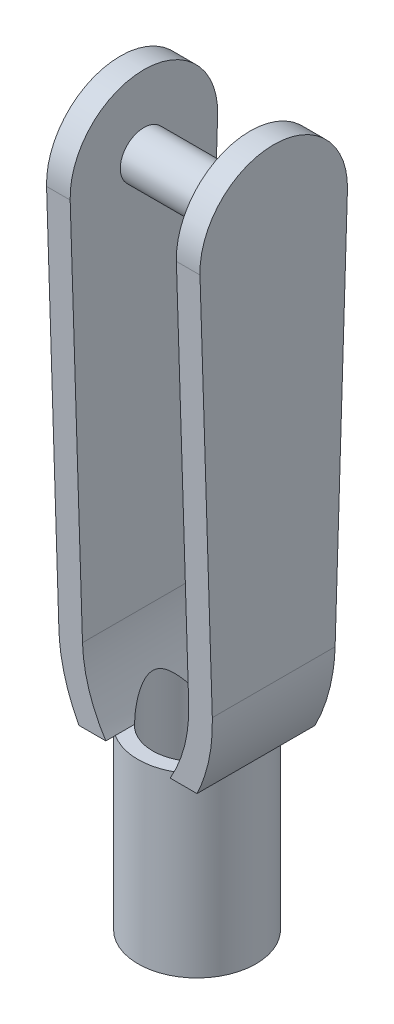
ISO-10303-21;
HEADER;
FILE_DESCRIPTION(('STEP AP214'),'2;1');
FILE_NAME('part.step','',(''),(''),'','','');
FILE_SCHEMA(('AUTOMOTIVE_DESIGN { 1 0 10303 214 1 1 1 1 }'));
ENDSEC;
DATA;
#1=APPLICATION_CONTEXT('core data for automotive mechanical design processes');
#2=APPLICATION_PROTOCOL_DEFINITION('international standard','automotive_design',2000,#1);
#3=PRODUCT_CONTEXT('',#1,'mechanical');
#4=PRODUCT('Part','Part','',(#3));
#5=PRODUCT_RELATED_PRODUCT_CATEGORY('part','',(#4));
#6=PRODUCT_DEFINITION_FORMATION('','',#4);
#7=PRODUCT_DEFINITION_CONTEXT('part definition',#1,'design');
#8=PRODUCT_DEFINITION('design','',#6,#7);
#9=PRODUCT_DEFINITION_SHAPE('','',#8);
#10=(LENGTH_UNIT() NAMED_UNIT(*) SI_UNIT(.MILLI.,.METRE.));
#11=(NAMED_UNIT(*) PLANE_ANGLE_UNIT() SI_UNIT($,.RADIAN.));
#12=(NAMED_UNIT(*) SI_UNIT($,.STERADIAN.) SOLID_ANGLE_UNIT());
#13=UNCERTAINTY_MEASURE_WITH_UNIT(LENGTH_MEASURE(1.E-05),#10,'distance_accuracy_value','');
#14=(GEOMETRIC_REPRESENTATION_CONTEXT(3) GLOBAL_UNCERTAINTY_ASSIGNED_CONTEXT((#13)) GLOBAL_UNIT_ASSIGNED_CONTEXT((#10,
#11,#12)) REPRESENTATION_CONTEXT('',''));
#15=CARTESIAN_POINT('',(0.,0.,0.));
#16=DIRECTION('',(0.,0.,1.));
#17=DIRECTION('',(1.,0.,0.));
#18=AXIS2_PLACEMENT_3D('',#15,#16,#17);
#19=CARTESIAN_POINT('',(0.,0.,0.));
#20=DIRECTION('',(0.,-1.,0.));
#21=DIRECTION('',(0.,0.,-1.));
#22=AXIS2_PLACEMENT_3D('',#19,#20,#21);
#23=PLANE('',#22);
#24=DIRECTION('',(0.,0.,1.));
#25=VECTOR('',#24,1.);
#26=CARTESIAN_POINT('',(1.08952211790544,0.,-3.));
#27=LINE('',#26,#25);
#28=CARTESIAN_POINT('',(1.08952211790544,0.,1.03099056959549));
#29=VERTEX_POINT('',#28);
#30=CARTESIAN_POINT('',(1.08952211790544,0.,1.67718262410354));
#31=VERTEX_POINT('',#30);
#32=EDGE_CURVE('E306',#29,#31,#27,.T.);
#33=ORIENTED_EDGE('',*,*,#32,.F.);
#34=CARTESIAN_POINT('',(0.,0.,0.));
#35=DIRECTION('',(0.,-1.,0.));
#36=DIRECTION('',(0.,0.,-1.));
#37=AXIS2_PLACEMENT_3D('',#34,#35,#36);
#38=CIRCLE('',#37,1.5);
#39=CARTESIAN_POINT('',(-1.08952211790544,0.,1.03099056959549));
#40=VERTEX_POINT('',#39);
#41=EDGE_CURVE('E167',#29,#40,#38,.T.);
#42=ORIENTED_EDGE('',*,*,#41,.T.);
#43=DIRECTION('',(0.,0.,1.));
#44=VECTOR('',#43,1.);
#45=CARTESIAN_POINT('',(-1.08952211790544,0.,-3.));
#46=LINE('',#45,#44);
#47=CARTESIAN_POINT('',(-1.08952211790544,0.,1.67718262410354));
#48=VERTEX_POINT('',#47);
#49=EDGE_CURVE('E176',#40,#48,#46,.T.);
#50=ORIENTED_EDGE('',*,*,#49,.T.);
#51=CARTESIAN_POINT('',(0.,0.,0.));
#52=DIRECTION('',(0.,-1.,0.));
#53=DIRECTION('',(0.,0.,-1.));
#54=AXIS2_PLACEMENT_3D('',#51,#52,#53);
#55=CIRCLE('',#54,2.);
#56=EDGE_CURVE('E540',#31,#48,#55,.T.);
#57=ORIENTED_EDGE('',*,*,#56,.F.);
#58=EDGE_LOOP('',(#33,#42,#50,#57));
#59=FACE_BOUND('',#58,.T.);
#60=ADVANCED_FACE('F36',(#59),#23,.F.);
#61=CARTESIAN_POINT('',(-2.,0.,3.));
#62=DIRECTION('',(0.,1.,0.));
#63=DIRECTION('',(0.,0.,1.));
#64=AXIS2_PLACEMENT_3D('',#61,#62,#63);
#65=PLANE('',#64);
#66=CARTESIAN_POINT('',(1.08952211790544,0.,-1.67718262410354));
#67=VERTEX_POINT('',#66);
#68=CARTESIAN_POINT('',(2.,0.,0.));
#69=VERTEX_POINT('',#68);
#70=EDGE_CURVE('E307',#67,#69,#55,.T.);
#71=ORIENTED_EDGE('',*,*,#70,.F.);
#72=CARTESIAN_POINT('',(1.08952211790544,0.,-2.));
#73=VERTEX_POINT('',#72);
#74=EDGE_CURVE('E311',#73,#67,#27,.T.);
#75=ORIENTED_EDGE('',*,*,#74,.F.);
#76=DIRECTION('',(1.,0.,0.));
#77=VECTOR('',#76,1.);
#78=CARTESIAN_POINT('',(-2.6,0.,-2.));
#79=LINE('',#78,#77);
#80=CARTESIAN_POINT('',(2.,0.,-2.));
#81=VERTEX_POINT('',#80);
#82=EDGE_CURVE('E553',#73,#81,#79,.T.);
#83=ORIENTED_EDGE('',*,*,#82,.T.);
#84=DIRECTION('',(0.,0.,-1.));
#85=VECTOR('',#84,1.);
#86=CARTESIAN_POINT('',(2.,0.,3.));
#87=LINE('',#86,#85);
#88=EDGE_CURVE('E504',#69,#81,#87,.T.);
#89=ORIENTED_EDGE('',*,*,#88,.F.);
#90=EDGE_LOOP('',(#71,#75,#83,#89));
#91=FACE_BOUND('',#90,.T.);
#92=ADVANCED_FACE('F38',(#91),#65,.F.);
#93=EDGE_CURVE('E47',#69,#31,#55,.T.);
#94=ORIENTED_EDGE('',*,*,#93,.F.);
#95=CARTESIAN_POINT('',(2.,0.,2.));
#96=VERTEX_POINT('',#95);
#97=EDGE_CURVE('E502',#96,#69,#87,.T.);
#98=ORIENTED_EDGE('',*,*,#97,.F.);
#99=DIRECTION('',(1.,0.,0.));
#100=VECTOR('',#99,1.);
#101=CARTESIAN_POINT('',(-2.6,0.,2.));
#102=LINE('',#101,#100);
#103=CARTESIAN_POINT('',(1.08952211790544,0.,2.));
#104=VERTEX_POINT('',#103);
#105=EDGE_CURVE('E541',#104,#96,#102,.T.);
#106=ORIENTED_EDGE('',*,*,#105,.F.);
#107=EDGE_CURVE('E310',#31,#104,#27,.T.);
#108=ORIENTED_EDGE('',*,*,#107,.F.);
#109=EDGE_LOOP('',(#94,#98,#106,#108));
#110=FACE_BOUND('',#109,.T.);
#111=ADVANCED_FACE('F248',(#110),#65,.F.);
#112=CARTESIAN_POINT('',(-2.,0.,3.));
#113=DIRECTION('',(0.,1.,0.));
#114=DIRECTION('',(0.,0.,1.));
#115=AXIS2_PLACEMENT_3D('',#112,#113,#114);
#116=PLANE('',#115);
#117=CARTESIAN_POINT('',(-2.,0.,0.));
#118=VERTEX_POINT('',#117);
#119=EDGE_CURVE('E11',#48,#118,#55,.T.);
#120=ORIENTED_EDGE('',*,*,#119,.F.);
#121=CARTESIAN_POINT('',(-1.08952211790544,0.,2.));
#122=VERTEX_POINT('',#121);
#123=EDGE_CURVE('E184',#48,#122,#46,.T.);
#124=ORIENTED_EDGE('',*,*,#123,.T.);
#125=DIRECTION('',(1.,0.,0.));
#126=VECTOR('',#125,1.);
#127=CARTESIAN_POINT('',(-2.6,0.,2.));
#128=LINE('',#127,#126);
#129=CARTESIAN_POINT('',(-2.,0.,2.));
#130=VERTEX_POINT('',#129);
#131=EDGE_CURVE('E321',#130,#122,#128,.T.);
#132=ORIENTED_EDGE('',*,*,#131,.F.);
#133=DIRECTION('',(0.,0.,-1.));
#134=VECTOR('',#133,1.);
#135=CARTESIAN_POINT('',(-2.,0.,3.));
#136=LINE('',#135,#134);
#137=EDGE_CURVE('E203',#130,#118,#136,.T.);
#138=ORIENTED_EDGE('',*,*,#137,.T.);
#139=EDGE_LOOP('',(#120,#124,#132,#138));
#140=FACE_BOUND('',#139,.T.);
#141=ADVANCED_FACE('F279',(#140),#116,.F.);
#142=CARTESIAN_POINT('',(-1.08952211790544,0.,-1.67718262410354));
#143=VERTEX_POINT('',#142);
#144=EDGE_CURVE('E45',#118,#143,#55,.T.);
#145=ORIENTED_EDGE('',*,*,#144,.F.);
#146=CARTESIAN_POINT('',(-2.,0.,-2.));
#147=VERTEX_POINT('',#146);
#148=EDGE_CURVE('E185',#118,#147,#136,.T.);
#149=ORIENTED_EDGE('',*,*,#148,.T.);
#150=DIRECTION('',(1.,0.,0.));
#151=VECTOR('',#150,1.);
#152=CARTESIAN_POINT('',(-2.6,0.,-2.));
#153=LINE('',#152,#151);
#154=CARTESIAN_POINT('',(-1.08952211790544,0.,-2.));
#155=VERTEX_POINT('',#154);
#156=EDGE_CURVE('E219',#147,#155,#153,.T.);
#157=ORIENTED_EDGE('',*,*,#156,.T.);
#158=EDGE_CURVE('E182',#155,#143,#46,.T.);
#159=ORIENTED_EDGE('',*,*,#158,.T.);
#160=EDGE_LOOP('',(#145,#149,#157,#159));
#161=FACE_BOUND('',#160,.T.);
#162=ADVANCED_FACE('F218',(#161),#116,.F.);
#163=CARTESIAN_POINT('',(1.8,2.56904651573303,-3.));
#164=DIRECTION('',(1.,0.,0.));
#165=DIRECTION('',(0.,1.,0.));
#166=AXIS2_PLACEMENT_3D('',#163,#164,#165);
#167=PLANE('',#166);
#168=CARTESIAN_POINT('',(1.8,15.85,0.));
#169=DIRECTION('',(1.,0.,0.));
#170=DIRECTION('',(0.,1.,0.));
#171=AXIS2_PLACEMENT_3D('',#168,#169,#170);
#172=CIRCLE('',#171,2.5);
#173=CARTESIAN_POINT('',(1.8,15.7709780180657,2.4987507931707));
#174=VERTEX_POINT('',#173);
#175=CARTESIAN_POINT('',(1.8,15.7709780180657,-2.4987507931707));
#176=VERTEX_POINT('',#175);
#177=EDGE_CURVE('E534',#174,#176,#172,.F.);
#178=ORIENTED_EDGE('',*,*,#177,.T.);
#179=DIRECTION('',(0.,-0.999500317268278,0.0316087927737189));
#180=VECTOR('',#179,1.);
#181=CARTESIAN_POINT('',(1.8,2.59807273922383,-2.08216299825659));
#182=LINE('',#181,#180);
#183=CARTESIAN_POINT('',(1.8,2.56904651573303,-2.08124505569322));
#184=VERTEX_POINT('',#183);
#185=EDGE_CURVE('E529',#176,#184,#182,.T.);
#186=ORIENTED_EDGE('',*,*,#185,.T.);
#187=DIRECTION('',(0.,0.,1.));
#188=VECTOR('',#187,1.);
#189=CARTESIAN_POINT('',(1.8,2.56904651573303,-3.));
#190=LINE('',#189,#188);
#191=CARTESIAN_POINT('',(1.8,2.56904651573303,2.08124505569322));
#192=VERTEX_POINT('',#191);
#193=EDGE_CURVE('E522',#184,#192,#190,.T.);
#194=ORIENTED_EDGE('',*,*,#193,.T.);
#195=DIRECTION('',(0.,0.999500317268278,0.0316087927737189));
#196=VECTOR('',#195,1.);
#197=CARTESIAN_POINT('',(1.8,2.40851474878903,2.07616830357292));
#198=LINE('',#197,#196);
#199=EDGE_CURVE('E551',#192,#174,#198,.T.);
#200=ORIENTED_EDGE('',*,*,#199,.T.);
#201=EDGE_LOOP('',(#178,#186,#194,#200));
#202=FACE_BOUND('',#201,.T.);
#203=CARTESIAN_POINT('',(1.8,15.85,0.));
#204=DIRECTION('',(1.,0.,0.));
#205=DIRECTION('',(0.,1.,0.));
#206=AXIS2_PLACEMENT_3D('',#203,#204,#205);
#207=CIRCLE('',#206,0.799999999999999);
#208=CARTESIAN_POINT('',(1.8,16.65,0.));
#209=VERTEX_POINT('',#208);
#210=EDGE_CURVE('E40',#209,#209,#207,.F.);
#211=ORIENTED_EDGE('',*,*,#210,.F.);
#212=EDGE_LOOP('',(#211));
#213=FACE_BOUND('',#212,.T.);
#214=ADVANCED_FACE('F342',(#202,#213),#167,.F.);
#215=CARTESIAN_POINT('',(-3.2,2.56904651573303,3.));
#216=DIRECTION('',(0.,0.,-1.));
#217=DIRECTION('',(-1.,0.,0.));
#218=AXIS2_PLACEMENT_3D('',#215,#216,#217);
#219=CYLINDRICAL_SURFACE('',#218,5.8);
#220=ORIENTED_EDGE('',*,*,#97,.T.);
#221=ORIENTED_EDGE('',*,*,#88,.T.);
#222=CARTESIAN_POINT('',(-3.2,2.56904651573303,-2.08124505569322));
#223=DIRECTION('',(0.,0.0316087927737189,0.999500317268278));
#224=DIRECTION('',(0.,0.999500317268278,-0.0316087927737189));
#225=AXIS2_PLACEMENT_3D('',#222,#223,#224);
#226=ELLIPSE('',#225,5.8028996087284,5.8);
#227=CARTESIAN_POINT('',(2.6,2.56904651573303,-2.08124505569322));
#228=VERTEX_POINT('',#227);
#229=EDGE_CURVE('E526',#81,#228,#226,.T.);
#230=ORIENTED_EDGE('',*,*,#229,.T.);
#231=DIRECTION('',(0.,0.,-1.));
#232=VECTOR('',#231,1.);
#233=CARTESIAN_POINT('',(2.6,2.56904651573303,3.));
#234=LINE('',#233,#232);
#235=CARTESIAN_POINT('',(2.6,2.56904651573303,2.08124505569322));
#236=VERTEX_POINT('',#235);
#237=EDGE_CURVE('E519',#236,#228,#234,.T.);
#238=ORIENTED_EDGE('',*,*,#237,.F.);
#239=CARTESIAN_POINT('',(-3.2,2.56904651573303,2.08124505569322));
#240=DIRECTION('',(0.,0.0316087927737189,-0.999500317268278));
#241=DIRECTION('',(0.,-0.999500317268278,-0.0316087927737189));
#242=AXIS2_PLACEMENT_3D('',#239,#240,#241);
#243=ELLIPSE('',#242,5.8028996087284,5.8);
#244=EDGE_CURVE('E507',#236,#96,#243,.T.);
#245=ORIENTED_EDGE('',*,*,#244,.T.);
#246=EDGE_LOOP('',(#220,#221,#230,#238,#245));
#247=FACE_BOUND('',#246,.T.);
#248=ADVANCED_FACE('F399',(#247),#219,.T.);
#249=CARTESIAN_POINT('',(2.6,2.56904651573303,3.));
#250=DIRECTION('',(-1.,0.,0.));
#251=DIRECTION('',(0.,0.,1.));
#252=AXIS2_PLACEMENT_3D('',#249,#250,#251);
#253=PLANE('',#252);
#254=ORIENTED_EDGE('',*,*,#237,.T.);
#255=DIRECTION('',(0.,-0.999500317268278,0.0316087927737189));
#256=VECTOR('',#255,1.);
#257=CARTESIAN_POINT('',(2.6,0.,-2.));
#258=LINE('',#257,#256);
#259=CARTESIAN_POINT('',(2.6,15.7709780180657,-2.4987507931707));
#260=VERTEX_POINT('',#259);
#261=EDGE_CURVE('E543',#260,#228,#258,.T.);
#262=ORIENTED_EDGE('',*,*,#261,.F.);
#263=CARTESIAN_POINT('',(2.6,15.85,0.));
#264=DIRECTION('',(-1.,0.,0.));
#265=DIRECTION('',(0.,0.,-1.));
#266=AXIS2_PLACEMENT_3D('',#263,#264,#265);
#267=CIRCLE('',#266,2.5);
#268=CARTESIAN_POINT('',(2.6,15.7709780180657,2.4987507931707));
#269=VERTEX_POINT('',#268);
#270=EDGE_CURVE('E547',#269,#260,#267,.T.);
#271=ORIENTED_EDGE('',*,*,#270,.F.);
#272=DIRECTION('',(0.,0.999500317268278,0.0316087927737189));
#273=VECTOR('',#272,1.);
#274=CARTESIAN_POINT('',(2.6,0.,2.));
#275=LINE('',#274,#273);
#276=EDGE_CURVE('E560',#236,#269,#275,.T.);
#277=ORIENTED_EDGE('',*,*,#276,.F.);
#278=EDGE_LOOP('',(#254,#262,#271,#277));
#279=FACE_BOUND('',#278,.T.);
#280=ADVANCED_FACE('F437',(#279),#253,.F.);
#281=CARTESIAN_POINT('',(-3.2,2.56904651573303,-3.));
#282=DIRECTION('',(0.,0.,1.));
#283=DIRECTION('',(1.,0.,0.));
#284=AXIS2_PLACEMENT_3D('',#281,#282,#283);
#285=CYLINDRICAL_SURFACE('',#284,5.);
#286=CARTESIAN_POINT('',(1.08952211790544,0.,-1.03099056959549));
#287=VERTEX_POINT('',#286);
#288=EDGE_CURVE('E308',#67,#287,#27,.T.);
#289=ORIENTED_EDGE('',*,*,#288,.T.);
#290=CARTESIAN_POINT('',(1.08952211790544,0.,-1.0309905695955));
#291=CARTESIAN_POINT('',(1.10677471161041,0.0288060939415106,-1.01275566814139));
#292=CARTESIAN_POINT('',(1.12360499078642,0.0575666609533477,-0.994056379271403));
#293=CARTESIAN_POINT('',(1.15642122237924,0.114930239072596,-0.955682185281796));
#294=CARTESIAN_POINT('',(1.17240696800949,0.143533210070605,-0.936007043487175));
#295=CARTESIAN_POINT('',(1.21940759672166,0.229574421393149,-0.875043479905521));
#296=CARTESIAN_POINT('',(1.24910835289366,0.28664549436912,-0.832192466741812));
#297=CARTESIAN_POINT('',(1.3065891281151,0.402234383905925,-0.738928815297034));
#298=CARTESIAN_POINT('',(1.33413683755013,0.460623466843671,-0.688212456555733));
#299=CARTESIAN_POINT('',(1.38458636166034,0.572729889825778,-0.58007144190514));
#300=CARTESIAN_POINT('',(1.40751130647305,0.626469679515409,-0.522682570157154));
#301=CARTESIAN_POINT('',(1.43856347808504,0.702340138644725,-0.426392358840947));
#302=CARTESIAN_POINT('',(1.44870460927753,0.727804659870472,-0.390808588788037));
#303=CARTESIAN_POINT('',(1.46673798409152,0.774008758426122,-0.316435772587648));
#304=CARTESIAN_POINT('',(1.4746471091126,0.794783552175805,-0.277673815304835));
#305=CARTESIAN_POINT('',(1.48577356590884,0.824424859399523,-0.208173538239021));
#306=CARTESIAN_POINT('',(1.48968553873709,0.834997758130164,-0.178289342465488));
#307=CARTESIAN_POINT('',(1.49573947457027,0.851458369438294,-0.11707060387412));
#308=CARTESIAN_POINT('',(1.49788347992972,0.857351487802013,-0.085737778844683));
#309=CARTESIAN_POINT('',(1.50017363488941,0.863648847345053,-0.022213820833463));
#310=CARTESIAN_POINT('',(1.50030624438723,0.8640158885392,0.00998166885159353));
#311=CARTESIAN_POINT('',(1.49852131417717,0.85910415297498,0.073882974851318));
#312=CARTESIAN_POINT('',(1.49660211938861,0.853820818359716,0.105588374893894));
#313=CARTESIAN_POINT('',(1.49037725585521,0.836864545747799,0.173683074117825));
#314=CARTESIAN_POINT('',(1.48567625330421,0.824138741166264,0.209766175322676));
#315=CARTESIAN_POINT('',(1.47418443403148,0.793583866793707,0.279339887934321));
#316=CARTESIAN_POINT('',(1.46738830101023,0.775741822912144,0.312823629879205));
#317=CARTESIAN_POINT('',(1.44600966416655,0.720801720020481,0.403306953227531));
#318=CARTESIAN_POINT('',(1.4295731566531,0.679794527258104,0.457442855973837));
#319=CARTESIAN_POINT('',(1.39277962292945,0.592007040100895,0.559574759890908));
#320=CARTESIAN_POINT('',(1.37239814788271,0.545191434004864,0.60752919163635));
#321=CARTESIAN_POINT('',(1.33238245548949,0.457316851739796,0.690257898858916));
#322=CARTESIAN_POINT('',(1.31328928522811,0.416764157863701,0.725841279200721));
#323=CARTESIAN_POINT('',(1.27305959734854,0.334355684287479,0.794290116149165));
#324=CARTESIAN_POINT('',(1.25192154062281,0.292498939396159,0.827153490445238));
#325=CARTESIAN_POINT('',(1.20823843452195,0.209047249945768,0.889708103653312));
#326=CARTESIAN_POINT('',(1.18574032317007,0.167470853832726,0.919457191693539));
#327=CARTESIAN_POINT('',(1.13896367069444,0.0839525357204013,0.976789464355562));
#328=CARTESIAN_POINT('',(1.11468820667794,0.0420113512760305,1.00437622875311));
#329=CARTESIAN_POINT('',(1.08952211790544,0.,1.03099056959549));
#330=B_SPLINE_CURVE_WITH_KNOTS('',3,(#290,#291,#292,#293,#294,#295,#296,#297,#298,#299,#300,
#301,#302,#303,#304,#305,#306,#307,#308,#309,#310,#311,#312,#313,#314,#315,#316,#317,#318,#319,
#320,#321,#322,#323,#324,#325,#326,#327,#328,#329),.UNSPECIFIED.,.F.,.F.,(4,2,2,2,2,2,2,2,2,2,2,
2,2,2,2,2,2,2,2,4),(0.,0.114615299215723,0.229258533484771,0.460917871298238,0.706900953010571,
0.951620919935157,1.08610104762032,1.21953499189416,1.31501224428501,1.41037904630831,
1.50638754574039,1.60247354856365,1.7174696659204,1.83276001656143,2.04122059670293,
2.25101705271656,2.42256985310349,2.5942527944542,2.76174507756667,2.92895394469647),.UNSPECIFIED.);
#331=EDGE_CURVE('E54',#287,#29,#330,.T.);
#332=ORIENTED_EDGE('',*,*,#331,.T.);
#333=ORIENTED_EDGE('',*,*,#32,.T.);
#334=ORIENTED_EDGE('',*,*,#107,.T.);
#335=CARTESIAN_POINT('',(-3.2,2.56904651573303,2.08124505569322));
#336=DIRECTION('',(0.,0.0316087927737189,-0.999500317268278));
#337=DIRECTION('',(0.,0.999500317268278,0.0316087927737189));
#338=AXIS2_PLACEMENT_3D('',#335,#336,#337);
#339=ELLIPSE('',#338,5.00249966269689,5.);
#340=EDGE_CURVE('E509',#104,#192,#339,.F.);
#341=ORIENTED_EDGE('',*,*,#340,.T.);
#342=ORIENTED_EDGE('',*,*,#193,.F.);
#343=CARTESIAN_POINT('',(-3.2,2.56904651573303,-2.08124505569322));
#344=DIRECTION('',(0.,0.0316087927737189,0.999500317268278));
#345=DIRECTION('',(0.,-0.999500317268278,0.0316087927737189));
#346=AXIS2_PLACEMENT_3D('',#343,#344,#345);
#347=ELLIPSE('',#346,5.00249966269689,5.);
#348=EDGE_CURVE('E518',#184,#73,#347,.F.);
#349=ORIENTED_EDGE('',*,*,#348,.T.);
#350=ORIENTED_EDGE('',*,*,#74,.T.);
#351=EDGE_LOOP('',(#289,#332,#333,#334,#341,#342,#349,#350));
#352=FACE_BOUND('',#351,.T.);
#353=ADVANCED_FACE('F429',(#352),#285,.F.);
#354=CARTESIAN_POINT('',(-2.6,15.85,0.));
#355=DIRECTION('',(1.,0.,0.));
#356=DIRECTION('',(0.,0.,-1.));
#357=AXIS2_PLACEMENT_3D('',#354,#355,#356);
#358=CYLINDRICAL_SURFACE('',#357,2.5);
#359=DIRECTION('',(1.,0.,0.));
#360=VECTOR('',#359,1.);
#361=CARTESIAN_POINT('',(-2.6,15.7709780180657,2.4987507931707));
#362=LINE('',#361,#360);
#363=EDGE_CURVE('E542',#174,#269,#362,.T.);
#364=ORIENTED_EDGE('',*,*,#363,.T.);
#365=ORIENTED_EDGE('',*,*,#270,.T.);
#366=DIRECTION('',(1.,0.,0.));
#367=VECTOR('',#366,1.);
#368=CARTESIAN_POINT('',(-2.6,15.7709780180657,-2.4987507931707));
#369=LINE('',#368,#367);
#370=EDGE_CURVE('E545',#176,#260,#369,.T.);
#371=ORIENTED_EDGE('',*,*,#370,.F.);
#372=ORIENTED_EDGE('',*,*,#177,.F.);
#373=EDGE_LOOP('',(#364,#365,#371,#372));
#374=FACE_BOUND('',#373,.T.);
#375=ADVANCED_FACE('F419',(#374),#358,.T.);
#376=CARTESIAN_POINT('',(-2.6,0.,-2.));
#377=DIRECTION('',(0.,0.0316087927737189,0.999500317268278));
#378=DIRECTION('',(0.,-0.999500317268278,0.0316087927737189));
#379=AXIS2_PLACEMENT_3D('',#376,#377,#378);
#380=PLANE('',#379);
#381=ORIENTED_EDGE('',*,*,#82,.F.);
#382=ORIENTED_EDGE('',*,*,#348,.F.);
#383=ORIENTED_EDGE('',*,*,#185,.F.);
#384=ORIENTED_EDGE('',*,*,#370,.T.);
#385=ORIENTED_EDGE('',*,*,#261,.T.);
#386=ORIENTED_EDGE('',*,*,#229,.F.);
#387=EDGE_LOOP('',(#381,#382,#383,#384,#385,#386));
#388=FACE_BOUND('',#387,.T.);
#389=ADVANCED_FACE('F409',(#388),#380,.F.);
#390=CARTESIAN_POINT('',(-2.6,0.,2.));
#391=DIRECTION('',(0.,0.0316087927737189,-0.999500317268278));
#392=DIRECTION('',(0.,0.999500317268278,0.0316087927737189));
#393=AXIS2_PLACEMENT_3D('',#390,#391,#392);
#394=PLANE('',#393);
#395=ORIENTED_EDGE('',*,*,#276,.T.);
#396=ORIENTED_EDGE('',*,*,#363,.F.);
#397=ORIENTED_EDGE('',*,*,#199,.F.);
#398=ORIENTED_EDGE('',*,*,#340,.F.);
#399=ORIENTED_EDGE('',*,*,#105,.T.);
#400=ORIENTED_EDGE('',*,*,#244,.F.);
#401=EDGE_LOOP('',(#395,#396,#397,#398,#399,#400));
#402=FACE_BOUND('',#401,.T.);
#403=ADVANCED_FACE('F389',(#402),#394,.F.);
#404=CARTESIAN_POINT('',(4.06274169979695,15.85,0.));
#405=DIRECTION('',(-1.,0.,0.));
#406=DIRECTION('',(0.,0.,1.));
#407=AXIS2_PLACEMENT_3D('',#404,#405,#406);
#408=CYLINDRICAL_SURFACE('',#407,0.799999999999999);
#409=CARTESIAN_POINT('',(-1.8,15.85,0.));
#410=DIRECTION('',(-1.,0.,0.));
#411=DIRECTION('',(0.,-1.,0.));
#412=AXIS2_PLACEMENT_3D('',#409,#410,#411);
#413=CIRCLE('',#412,0.799999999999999);
#414=CARTESIAN_POINT('',(-1.8,15.05,0.));
#415=VERTEX_POINT('',#414);
#416=EDGE_CURVE('E568',#415,#415,#413,.T.);
#417=ORIENTED_EDGE('',*,*,#416,.F.);
#418=EDGE_LOOP('',(#417));
#419=FACE_BOUND('',#418,.T.);
#420=ORIENTED_EDGE('',*,*,#210,.T.);
#421=EDGE_LOOP('',(#420));
#422=FACE_BOUND('',#421,.T.);
#423=ADVANCED_FACE('F238',(#419,#422),#408,.T.);
#424=CARTESIAN_POINT('',(-1.8,18.4,-3.));
#425=DIRECTION('',(-1.,0.,0.));
#426=DIRECTION('',(0.,-1.,0.));
#427=AXIS2_PLACEMENT_3D('',#424,#425,#426);
#428=PLANE('',#427);
#429=DIRECTION('',(0.,0.,1.));
#430=VECTOR('',#429,1.);
#431=CARTESIAN_POINT('',(-1.8,2.56904651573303,-3.));
#432=LINE('',#431,#430);
#433=CARTESIAN_POINT('',(-1.8,2.56904651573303,-2.08124505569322));
#434=VERTEX_POINT('',#433);
#435=CARTESIAN_POINT('',(-1.8,2.56904651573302,2.08124505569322));
#436=VERTEX_POINT('',#435);
#437=EDGE_CURVE('E204',#434,#436,#432,.T.);
#438=ORIENTED_EDGE('',*,*,#437,.F.);
#439=DIRECTION('',(0.,0.999500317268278,-0.0316087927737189));
#440=VECTOR('',#439,1.);
#441=CARTESIAN_POINT('',(-1.8,18.4132092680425,-2.58231028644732));
#442=LINE('',#441,#440);
#443=CARTESIAN_POINT('',(-1.8,15.7709780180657,-2.4987507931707));
#444=VERTEX_POINT('',#443);
#445=EDGE_CURVE('E335',#434,#444,#442,.T.);
#446=ORIENTED_EDGE('',*,*,#445,.T.);
#447=CARTESIAN_POINT('',(-1.8,15.85,0.));
#448=DIRECTION('',(-1.,0.,0.));
#449=DIRECTION('',(0.,-1.,0.));
#450=AXIS2_PLACEMENT_3D('',#447,#448,#449);
#451=CIRCLE('',#450,2.5);
#452=CARTESIAN_POINT('',(-1.8,15.7709780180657,2.4987507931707));
#453=VERTEX_POINT('',#452);
#454=EDGE_CURVE('E211',#444,#453,#451,.F.);
#455=ORIENTED_EDGE('',*,*,#454,.T.);
#456=DIRECTION('',(0.,-0.999500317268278,-0.0316087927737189));
#457=VECTOR('',#456,1.);
#458=CARTESIAN_POINT('',(-1.8,18.2236512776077,2.57631559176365));
#459=LINE('',#458,#457);
#460=EDGE_CURVE('E206',#453,#436,#459,.T.);
#461=ORIENTED_EDGE('',*,*,#460,.T.);
#462=EDGE_LOOP('',(#438,#446,#455,#461));
#463=FACE_BOUND('',#462,.T.);
#464=ORIENTED_EDGE('',*,*,#416,.T.);
#465=EDGE_LOOP('',(#464));
#466=FACE_BOUND('',#465,.T.);
#467=ADVANCED_FACE('F230',(#463,#466),#428,.F.);
#468=CARTESIAN_POINT('',(3.2,2.56904651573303,3.));
#469=DIRECTION('',(0.,0.,-1.));
#470=DIRECTION('',(-1.,0.,0.));
#471=AXIS2_PLACEMENT_3D('',#468,#469,#470);
#472=CYLINDRICAL_SURFACE('',#471,5.8);
#473=DIRECTION('',(0.,0.,-1.));
#474=VECTOR('',#473,1.);
#475=CARTESIAN_POINT('',(-2.6,2.56904651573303,3.));
#476=LINE('',#475,#474);
#477=CARTESIAN_POINT('',(-2.6,2.56904651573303,2.08124505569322));
#478=VERTEX_POINT('',#477);
#479=CARTESIAN_POINT('',(-2.6,2.56904651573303,-2.08124505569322));
#480=VERTEX_POINT('',#479);
#481=EDGE_CURVE('E188',#478,#480,#476,.T.);
#482=ORIENTED_EDGE('',*,*,#481,.T.);
#483=CARTESIAN_POINT('',(3.2,2.56904651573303,-2.08124505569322));
#484=DIRECTION('',(0.,0.0316087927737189,0.999500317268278));
#485=DIRECTION('',(0.,0.999500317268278,-0.0316087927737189));
#486=AXIS2_PLACEMENT_3D('',#483,#484,#485);
#487=ELLIPSE('',#486,5.8028996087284,5.8);
#488=EDGE_CURVE('E194',#480,#147,#487,.T.);
#489=ORIENTED_EDGE('',*,*,#488,.T.);
#490=ORIENTED_EDGE('',*,*,#148,.F.);
#491=ORIENTED_EDGE('',*,*,#137,.F.);
#492=CARTESIAN_POINT('',(3.2,2.56904651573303,2.08124505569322));
#493=DIRECTION('',(0.,0.0316087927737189,-0.999500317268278));
#494=DIRECTION('',(0.,-0.999500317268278,-0.0316087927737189));
#495=AXIS2_PLACEMENT_3D('',#492,#493,#494);
#496=ELLIPSE('',#495,5.8028996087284,5.8);
#497=EDGE_CURVE('E330',#130,#478,#496,.T.);
#498=ORIENTED_EDGE('',*,*,#497,.T.);
#499=EDGE_LOOP('',(#482,#489,#490,#491,#498));
#500=FACE_BOUND('',#499,.T.);
#501=ADVANCED_FACE('F227',(#500),#472,.T.);
#502=CARTESIAN_POINT('',(-2.6,2.56904651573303,3.));
#503=DIRECTION('',(1.,0.,0.));
#504=DIRECTION('',(0.,0.,-1.));
#505=AXIS2_PLACEMENT_3D('',#502,#503,#504);
#506=PLANE('',#505);
#507=CARTESIAN_POINT('',(-2.6,15.85,0.));
#508=DIRECTION('',(-1.,0.,0.));
#509=DIRECTION('',(0.,0.,-1.));
#510=AXIS2_PLACEMENT_3D('',#507,#508,#509);
#511=CIRCLE('',#510,2.5);
#512=CARTESIAN_POINT('',(-2.6,15.7709780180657,2.4987507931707));
#513=VERTEX_POINT('',#512);
#514=CARTESIAN_POINT('',(-2.6,15.7709780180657,-2.4987507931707));
#515=VERTEX_POINT('',#514);
#516=EDGE_CURVE('E317',#513,#515,#511,.T.);
#517=ORIENTED_EDGE('',*,*,#516,.T.);
#518=DIRECTION('',(0.,-0.999500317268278,0.0316087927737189));
#519=VECTOR('',#518,1.);
#520=CARTESIAN_POINT('',(-2.6,0.,-2.));
#521=LINE('',#520,#519);
#522=EDGE_CURVE('E320',#515,#480,#521,.T.);
#523=ORIENTED_EDGE('',*,*,#522,.T.);
#524=ORIENTED_EDGE('',*,*,#481,.F.);
#525=DIRECTION('',(0.,0.999500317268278,0.0316087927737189));
#526=VECTOR('',#525,1.);
#527=CARTESIAN_POINT('',(-2.6,0.,2.));
#528=LINE('',#527,#526);
#529=EDGE_CURVE('E314',#478,#513,#528,.T.);
#530=ORIENTED_EDGE('',*,*,#529,.T.);
#531=EDGE_LOOP('',(#517,#523,#524,#530));
#532=FACE_BOUND('',#531,.T.);
#533=ADVANCED_FACE('F229',(#532),#506,.F.);
#534=CARTESIAN_POINT('',(3.2,2.56904651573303,-3.));
#535=DIRECTION('',(0.,0.,1.));
#536=DIRECTION('',(1.,0.,0.));
#537=AXIS2_PLACEMENT_3D('',#534,#535,#536);
#538=CYLINDRICAL_SURFACE('',#537,5.);
#539=ORIENTED_EDGE('',*,*,#49,.F.);
#540=CARTESIAN_POINT('',(-1.08952211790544,0.,1.03099056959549));
#541=CARTESIAN_POINT('',(-1.10677471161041,0.0288060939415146,1.01275566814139));
#542=CARTESIAN_POINT('',(-1.12360499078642,0.0575666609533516,0.9940563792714));
#543=CARTESIAN_POINT('',(-1.15642122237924,0.114930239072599,0.955682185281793));
#544=CARTESIAN_POINT('',(-1.17240696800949,0.143533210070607,0.936007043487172));
#545=CARTESIAN_POINT('',(-1.21940759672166,0.229574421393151,0.875043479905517));
#546=CARTESIAN_POINT('',(-1.24910835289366,0.286645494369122,0.83219246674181));
#547=CARTESIAN_POINT('',(-1.3065891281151,0.402234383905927,0.738928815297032));
#548=CARTESIAN_POINT('',(-1.33413683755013,0.46062346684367,0.688212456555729));
#549=CARTESIAN_POINT('',(-1.38458636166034,0.572729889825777,0.580071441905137));
#550=CARTESIAN_POINT('',(-1.40751130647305,0.626469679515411,0.522682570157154));
#551=CARTESIAN_POINT('',(-1.43856347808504,0.702340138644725,0.426392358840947));
#552=CARTESIAN_POINT('',(-1.44870460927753,0.727804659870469,0.390808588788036));
#553=CARTESIAN_POINT('',(-1.46673798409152,0.774008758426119,0.316435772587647));
#554=CARTESIAN_POINT('',(-1.4746471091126,0.794783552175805,0.277673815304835));
#555=CARTESIAN_POINT('',(-1.48577356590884,0.824424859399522,0.208173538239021));
#556=CARTESIAN_POINT('',(-1.48968553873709,0.834997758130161,0.178289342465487));
#557=CARTESIAN_POINT('',(-1.49573947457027,0.851458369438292,0.11707060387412));
#558=CARTESIAN_POINT('',(-1.49788347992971,0.857351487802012,0.0857377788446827));
#559=CARTESIAN_POINT('',(-1.50017363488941,0.863648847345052,0.0222138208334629));
#560=CARTESIAN_POINT('',(-1.50030624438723,0.864015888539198,-0.00998166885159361));
#561=CARTESIAN_POINT('',(-1.49852131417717,0.859104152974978,-0.0738829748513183));
#562=CARTESIAN_POINT('',(-1.49660211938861,0.853820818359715,-0.105588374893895));
#563=CARTESIAN_POINT('',(-1.49037725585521,0.836864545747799,-0.173683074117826));
#564=CARTESIAN_POINT('',(-1.48567625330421,0.824138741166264,-0.209766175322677));
#565=CARTESIAN_POINT('',(-1.47418443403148,0.793583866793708,-0.279339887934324));
#566=CARTESIAN_POINT('',(-1.46738830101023,0.775741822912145,-0.312823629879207));
#567=CARTESIAN_POINT('',(-1.44600966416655,0.720801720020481,-0.403306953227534));
#568=CARTESIAN_POINT('',(-1.42957315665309,0.679794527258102,-0.45744285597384));
#569=CARTESIAN_POINT('',(-1.39277962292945,0.592007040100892,-0.55957475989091));
#570=CARTESIAN_POINT('',(-1.37239814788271,0.54519143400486,-0.607529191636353));
#571=CARTESIAN_POINT('',(-1.33238245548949,0.457316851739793,-0.690257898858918));
#572=CARTESIAN_POINT('',(-1.31328928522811,0.4167641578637,-0.725841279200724));
#573=CARTESIAN_POINT('',(-1.27305959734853,0.334355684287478,-0.794290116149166));
#574=CARTESIAN_POINT('',(-1.25192154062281,0.292498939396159,-0.827153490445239));
#575=CARTESIAN_POINT('',(-1.20823843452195,0.209047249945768,-0.889708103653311));
#576=CARTESIAN_POINT('',(-1.18574032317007,0.167470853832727,-0.919457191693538));
#577=CARTESIAN_POINT('',(-1.13896367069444,0.0839525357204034,-0.97678946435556));
#578=CARTESIAN_POINT('',(-1.11468820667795,0.0420113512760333,-1.00437622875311));
#579=CARTESIAN_POINT('',(-1.08952211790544,0.,-1.03099056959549));
#580=B_SPLINE_CURVE_WITH_KNOTS('',3,(#540,#541,#542,#543,#544,#545,#546,#547,#548,#549,#550,
#551,#552,#553,#554,#555,#556,#557,#558,#559,#560,#561,#562,#563,#564,#565,#566,#567,#568,#569,
#570,#571,#572,#573,#574,#575,#576,#577,#578,#579),.UNSPECIFIED.,.F.,.F.,(4,2,2,2,2,2,2,2,2,2,2,
2,2,2,2,2,2,2,2,4),(0.,0.114615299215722,0.229258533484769,0.460917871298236,0.706900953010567,
0.951620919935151,1.08610104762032,1.21953499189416,1.315012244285,1.41037904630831,
1.50638754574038,1.60247354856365,1.71746966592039,1.83276001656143,2.04122059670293,
2.25101705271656,2.42256985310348,2.59425279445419,2.76174507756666,2.92895394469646),.UNSPECIFIED.);
#581=CARTESIAN_POINT('',(-1.08952211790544,0.,-1.03099056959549));
#582=VERTEX_POINT('',#581);
#583=EDGE_CURVE('E159',#40,#582,#580,.T.);
#584=ORIENTED_EDGE('',*,*,#583,.T.);
#585=EDGE_CURVE('E173',#143,#582,#46,.T.);
#586=ORIENTED_EDGE('',*,*,#585,.F.);
#587=ORIENTED_EDGE('',*,*,#158,.F.);
#588=CARTESIAN_POINT('',(3.2,2.56904651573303,-2.08124505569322));
#589=DIRECTION('',(0.,0.0316087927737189,0.999500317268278));
#590=DIRECTION('',(0.,-0.999500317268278,0.0316087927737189));
#591=AXIS2_PLACEMENT_3D('',#588,#589,#590);
#592=ELLIPSE('',#591,5.00249966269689,5.);
#593=EDGE_CURVE('E200',#155,#434,#592,.F.);
#594=ORIENTED_EDGE('',*,*,#593,.T.);
#595=ORIENTED_EDGE('',*,*,#437,.T.);
#596=CARTESIAN_POINT('',(3.2,2.56904651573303,2.08124505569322));
#597=DIRECTION('',(0.,0.0316087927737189,-0.999500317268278));
#598=DIRECTION('',(0.,0.999500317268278,0.0316087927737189));
#599=AXIS2_PLACEMENT_3D('',#596,#597,#598);
#600=ELLIPSE('',#599,5.00249966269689,5.);
#601=EDGE_CURVE('E224',#436,#122,#600,.F.);
#602=ORIENTED_EDGE('',*,*,#601,.T.);
#603=ORIENTED_EDGE('',*,*,#123,.F.);
#604=EDGE_LOOP('',(#539,#584,#586,#587,#594,#595,#602,#603));
#605=FACE_BOUND('',#604,.T.);
#606=ADVANCED_FACE('F171',(#605),#538,.F.);
#607=CARTESIAN_POINT('',(-2.6,0.,-2.));
#608=DIRECTION('',(0.,0.0316087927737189,0.999500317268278));
#609=DIRECTION('',(0.,-0.999500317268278,0.0316087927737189));
#610=AXIS2_PLACEMENT_3D('',#607,#608,#609);
#611=PLANE('',#610);
#612=ORIENTED_EDGE('',*,*,#522,.F.);
#613=DIRECTION('',(1.,0.,0.));
#614=VECTOR('',#613,1.);
#615=CARTESIAN_POINT('',(-2.6,15.7709780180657,-2.4987507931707));
#616=LINE('',#615,#614);
#617=EDGE_CURVE('E225',#515,#444,#616,.T.);
#618=ORIENTED_EDGE('',*,*,#617,.T.);
#619=ORIENTED_EDGE('',*,*,#445,.F.);
#620=ORIENTED_EDGE('',*,*,#593,.F.);
#621=ORIENTED_EDGE('',*,*,#156,.F.);
#622=ORIENTED_EDGE('',*,*,#488,.F.);
#623=EDGE_LOOP('',(#612,#618,#619,#620,#621,#622));
#624=FACE_BOUND('',#623,.T.);
#625=ADVANCED_FACE('F222',(#624),#611,.F.);
#626=CARTESIAN_POINT('',(-2.6,15.85,0.));
#627=DIRECTION('',(1.,0.,0.));
#628=DIRECTION('',(0.,0.,-1.));
#629=AXIS2_PLACEMENT_3D('',#626,#627,#628);
#630=CYLINDRICAL_SURFACE('',#629,2.5);
#631=ORIENTED_EDGE('',*,*,#617,.F.);
#632=ORIENTED_EDGE('',*,*,#516,.F.);
#633=DIRECTION('',(1.,0.,0.));
#634=VECTOR('',#633,1.);
#635=CARTESIAN_POINT('',(-2.6,15.7709780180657,2.4987507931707));
#636=LINE('',#635,#634);
#637=EDGE_CURVE('E325',#513,#453,#636,.T.);
#638=ORIENTED_EDGE('',*,*,#637,.T.);
#639=ORIENTED_EDGE('',*,*,#454,.F.);
#640=EDGE_LOOP('',(#631,#632,#638,#639));
#641=FACE_BOUND('',#640,.T.);
#642=ADVANCED_FACE('F262',(#641),#630,.T.);
#643=CARTESIAN_POINT('',(-2.6,0.,2.));
#644=DIRECTION('',(0.,0.0316087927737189,-0.999500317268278));
#645=DIRECTION('',(0.,0.999500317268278,0.0316087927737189));
#646=AXIS2_PLACEMENT_3D('',#643,#644,#645);
#647=PLANE('',#646);
#648=ORIENTED_EDGE('',*,*,#131,.T.);
#649=ORIENTED_EDGE('',*,*,#601,.F.);
#650=ORIENTED_EDGE('',*,*,#460,.F.);
#651=ORIENTED_EDGE('',*,*,#637,.F.);
#652=ORIENTED_EDGE('',*,*,#529,.F.);
#653=ORIENTED_EDGE('',*,*,#497,.F.);
#654=EDGE_LOOP('',(#648,#649,#650,#651,#652,#653));
#655=FACE_BOUND('',#654,.T.);
#656=ADVANCED_FACE('F255',(#655),#647,.F.);
#657=ORIENTED_EDGE('',*,*,#585,.T.);
#658=EDGE_CURVE('E156',#582,#287,#38,.T.);
#659=ORIENTED_EDGE('',*,*,#658,.T.);
#660=ORIENTED_EDGE('',*,*,#288,.F.);
#661=EDGE_CURVE('E180',#143,#67,#55,.T.);
#662=ORIENTED_EDGE('',*,*,#661,.F.);
#663=EDGE_LOOP('',(#657,#659,#660,#662));
#664=FACE_BOUND('',#663,.T.);
#665=ADVANCED_FACE('F178',(#664),#23,.F.);
#666=CARTESIAN_POINT('',(0.,-6.,0.));
#667=DIRECTION('',(0.,1.,0.));
#668=DIRECTION('',(0.,0.,1.));
#669=AXIS2_PLACEMENT_3D('',#666,#667,#668);
#670=CYLINDRICAL_SURFACE('',#669,2.);
#671=CARTESIAN_POINT('',(0.,-6.,0.));
#672=DIRECTION('',(0.,-1.,0.));
#673=DIRECTION('',(0.,0.,-1.));
#674=AXIS2_PLACEMENT_3D('',#671,#672,#673);
#675=CIRCLE('',#674,2.);
#676=CARTESIAN_POINT('',(0.,-6.,-2.));
#677=VERTEX_POINT('',#676);
#678=EDGE_CURVE('E305',#677,#677,#675,.T.);
#679=ORIENTED_EDGE('',*,*,#678,.F.);
#680=EDGE_LOOP('',(#679));
#681=FACE_BOUND('',#680,.T.);
#682=ORIENTED_EDGE('',*,*,#70,.T.);
#683=ORIENTED_EDGE('',*,*,#93,.T.);
#684=ORIENTED_EDGE('',*,*,#56,.T.);
#685=ORIENTED_EDGE('',*,*,#119,.T.);
#686=ORIENTED_EDGE('',*,*,#144,.T.);
#687=ORIENTED_EDGE('',*,*,#661,.T.);
#688=EDGE_LOOP('',(#682,#683,#684,#685,#686,#687));
#689=FACE_BOUND('',#688,.T.);
#690=ADVANCED_FACE('F254',(#681,#689),#670,.T.);
#691=CARTESIAN_POINT('',(0.,-6.,0.));
#692=DIRECTION('',(0.,-1.,0.));
#693=DIRECTION('',(0.,0.,-1.));
#694=AXIS2_PLACEMENT_3D('',#691,#692,#693);
#695=PLANE('',#694);
#696=CARTESIAN_POINT('',(0.,-6.,0.));
#697=DIRECTION('',(0.,-1.,0.));
#698=DIRECTION('',(0.,0.,-1.));
#699=AXIS2_PLACEMENT_3D('',#696,#697,#698);
#700=CIRCLE('',#699,1.5);
#701=CARTESIAN_POINT('',(0.,-6.,-1.5));
#702=VERTEX_POINT('',#701);
#703=EDGE_CURVE('E165',#702,#702,#700,.T.);
#704=ORIENTED_EDGE('',*,*,#703,.F.);
#705=EDGE_LOOP('',(#704));
#706=FACE_BOUND('',#705,.T.);
#707=ORIENTED_EDGE('',*,*,#678,.T.);
#708=EDGE_LOOP('',(#707));
#709=FACE_BOUND('',#708,.T.);
#710=ADVANCED_FACE('F260',(#706,#709),#695,.T.);
#711=CARTESIAN_POINT('',(0.,4.,0.));
#712=DIRECTION('',(0.,-1.,0.));
#713=DIRECTION('',(0.,0.,-1.));
#714=AXIS2_PLACEMENT_3D('',#711,#712,#713);
#715=CYLINDRICAL_SURFACE('',#714,1.5);
#716=ORIENTED_EDGE('',*,*,#703,.T.);
#717=EDGE_LOOP('',(#716));
#718=FACE_BOUND('',#717,.T.);
#719=ORIENTED_EDGE('',*,*,#331,.F.);
#720=ORIENTED_EDGE('',*,*,#658,.F.);
#721=ORIENTED_EDGE('',*,*,#583,.F.);
#722=ORIENTED_EDGE('',*,*,#41,.F.);
#723=EDGE_LOOP('',(#719,#720,#721,#722));
#724=FACE_BOUND('',#723,.T.);
#725=ADVANCED_FACE('F158',(#718,#724),#715,.F.);
#726=CLOSED_SHELL('',(#60,#92,#111,#141,#162,#214,#248,#280,#353,#375,#389,#403,#423,#467,#501,
#533,#606,#625,#642,#656,#665,#690,#710,#725));
#727=MANIFOLD_SOLID_BREP('B2',#726);
#728=ADVANCED_BREP_SHAPE_REPRESENTATION('',(#18,#727),#14);
#729=SHAPE_DEFINITION_REPRESENTATION(#9,#728);
ENDSEC;
END-ISO-10303-21;
